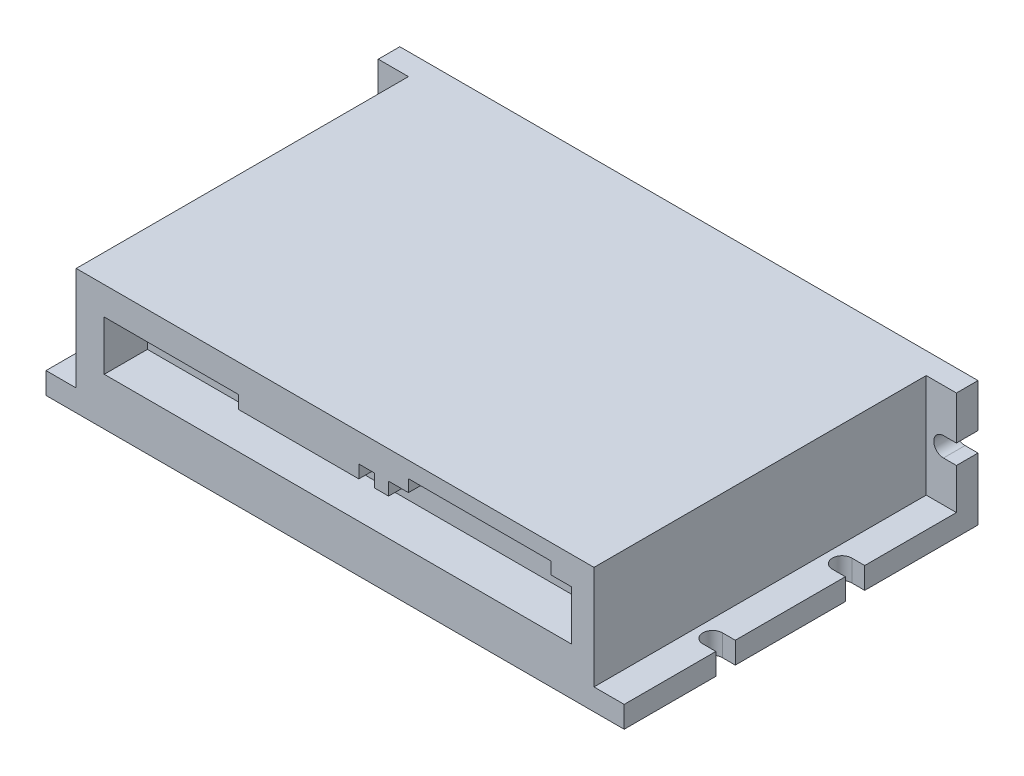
from build123d import *

# Parameters (mm, degrees)
SKETCH_1_W          = 134
SKETCH_1_H          = 82
EXTRUDE_1_DEPTH     = 29
SKETCH_2_W          = 7
SKETCH_2_H          = 24
CUT_EXTRUDE_1_DEPTH = 77
CUT_EXTRUDE_2_DEPTH = 52
CUT_EXTRUDE_3_DEPTH = 5
CUT_EXTRUDE_4_DEPTH = 10


with BuildPart() as part:
    # Sketch 1 → Extrude 1 (new body)
    with BuildSketch(Plane(origin=(0, 0, 0), x_dir=(1, 0, 0), z_dir=(0, 1, 0))):
        with Locations((67, 41)):
            Rectangle(SKETCH_1_W, SKETCH_1_H)
    extrude(amount=EXTRUDE_1_DEPTH)

    # Sketch 2 → Cut-Extrude 1 (cut)
    with BuildSketch(Plane.XY):
        with Locations((3.5, 17)):
            Rectangle(SKETCH_2_W, SKETCH_2_H)
        with Locations((130.5, 17)):
            Rectangle(SKETCH_2_W, SKETCH_2_H)
    extrude(amount=-CUT_EXTRUDE_1_DEPTH, mode=Mode.SUBTRACT)

    # Sketch 3 → Cut-Extrude 2 (cut)
    with BuildSketch(Plane.XY.offset(-77)):
        with BuildLine():
            Line((131, 18.95), (134, 18.95))
            Line((134, 18.95), (134, 14.45))
            Line((134, 14.45), (131, 14.45))
            ThreePointArc((131, 14.45), (128.75, 16.7), (131, 18.95))
        make_face()
        with BuildLine():
            Line((3, 18.95), (0, 18.95))
            Line((0, 18.95), (0, 14.45))
            Line((0, 14.45), (3, 14.45))
            ThreePointArc((3, 14.45), (5.25, 16.7), (3, 18.95))
        make_face()
    extrude(amount=-CUT_EXTRUDE_2_DEPTH, mode=Mode.SUBTRACT)

    # Sketch 4 → Cut-Extrude 3 (cut)
    with BuildSketch(Plane(origin=(0, 5, 0), x_dir=(1, 0, 0), z_dir=(0, 1, 0))):
        with BuildLine():
            Line((3, 25.75), (0, 25.75))
            Line((0, 25.75), (0, 21.25))
            Line((0, 21.25), (3, 21.25))
            ThreePointArc((3, 21.25), (5.25, 23.5), (3, 25.75))
        make_face()
        with BuildLine():
            Line((3, 55.75), (0, 55.75))
            Line((0, 55.75), (0, 51.25))
            Line((0, 51.25), (3, 51.25))
            ThreePointArc((3, 51.25), (5.25, 53.5), (3, 55.75))
        make_face()
        with BuildLine():
            Line((131, 55.75), (134, 55.75))
            Line((134, 55.75), (134, 51.25))
            Line((134, 51.25), (131, 51.25))
            ThreePointArc((131, 51.25), (128.75, 53.5), (131, 55.75))
        make_face()
        with BuildLine():
            Line((131, 25.75), (134, 25.75))
            Line((134, 25.75), (134, 21.25))
            Line((134, 21.25), (131, 21.25))
            ThreePointArc((131, 21.25), (128.75, 23.5), (131, 25.75))
        make_face()
    extrude(amount=-CUT_EXTRUDE_3_DEPTH, mode=Mode.SUBTRACT)

    # Sketch 5 → Cut-Extrude 4 (cut)
    with BuildSketch(Plane.XY):
        Polygon((13.5, 11), (121.8, 11), (121.8, 22.5), (117, 22.5), (117, 25.3), (84, 25.3), (84, 22.5), (79.4, 22.5), (79.4, 19.5), (76.1, 19.5), (76.1, 22.5), (72.5, 22.5), (72.5, 19.5), (44.6, 19.5), (44.6, 22.5), (13.5, 22.5), align=None)
    extrude(amount=-CUT_EXTRUDE_4_DEPTH, mode=Mode.SUBTRACT)


solid = part.part
